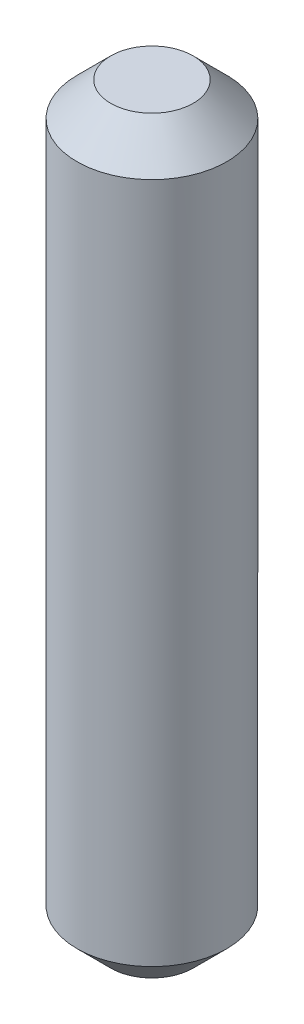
from build123d import *

# Parameters (mm, degrees)
SKETCH1_W     = 1
SKETCH1_H     = 10
CHAMFER1_SIZE = 0.45


with BuildPart() as part:
    # Sketch1 → Revolve1 (revolve)
    with BuildSketch(Plane.XY):
        with Locations((-0.5, 0)):
            Rectangle(SKETCH1_W, SKETCH1_H)
    revolve(axis=Axis((0, 5, 0), (0, -1, 0)))

    # Chamfer1
    chamfer1_edges = [part.edges().sort_by_distance(p)[0] for p in [
        (1, 5, 0),
        (1, -5, 0),
    ]]
    chamfer(chamfer1_edges, length=CHAMFER1_SIZE)


solid = part.part
